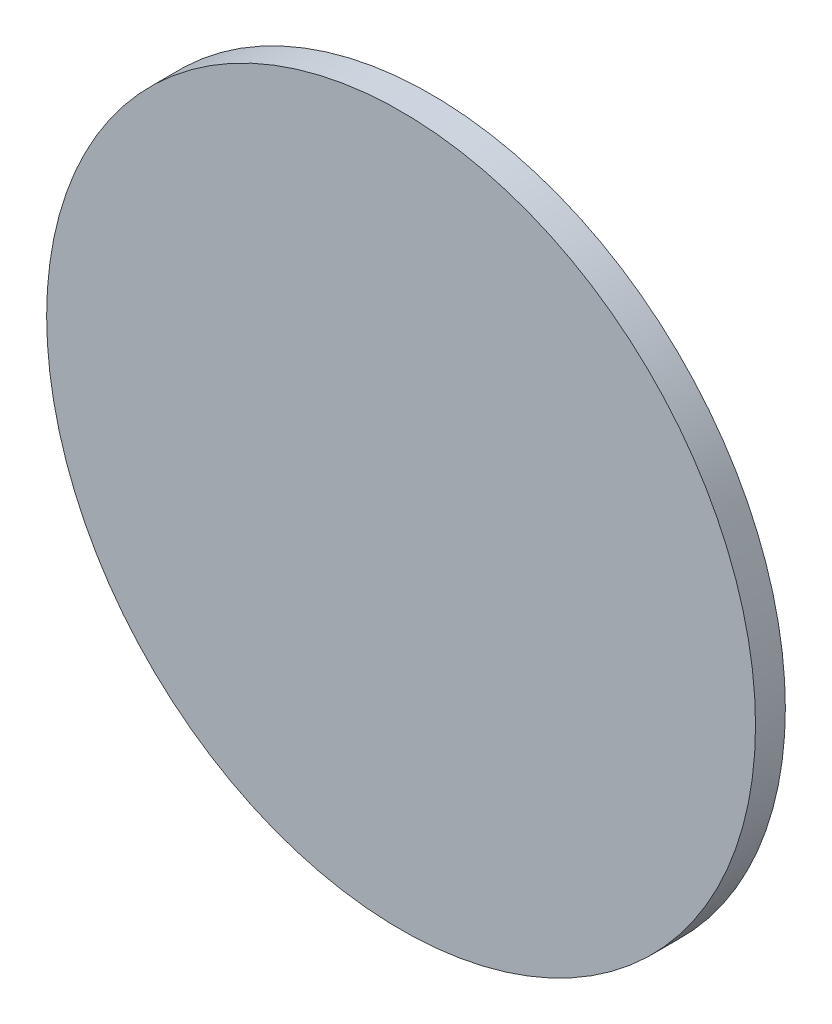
ISO-10303-21;
HEADER;
FILE_DESCRIPTION(('STEP AP214'),'2;1');
FILE_NAME('part.step','',(''),(''),'','','');
FILE_SCHEMA(('AUTOMOTIVE_DESIGN { 1 0 10303 214 1 1 1 1 }'));
ENDSEC;
DATA;
#1=APPLICATION_CONTEXT('core data for automotive mechanical design processes');
#2=APPLICATION_PROTOCOL_DEFINITION('international standard','automotive_design',2000,#1);
#3=PRODUCT_CONTEXT('',#1,'mechanical');
#4=PRODUCT('Part','Part','',(#3));
#5=PRODUCT_RELATED_PRODUCT_CATEGORY('part','',(#4));
#6=PRODUCT_DEFINITION_FORMATION('','',#4);
#7=PRODUCT_DEFINITION_CONTEXT('part definition',#1,'design');
#8=PRODUCT_DEFINITION('design','',#6,#7);
#9=PRODUCT_DEFINITION_SHAPE('','',#8);
#10=(LENGTH_UNIT() NAMED_UNIT(*) SI_UNIT(.MILLI.,.METRE.));
#11=(NAMED_UNIT(*) PLANE_ANGLE_UNIT() SI_UNIT($,.RADIAN.));
#12=(NAMED_UNIT(*) SI_UNIT($,.STERADIAN.) SOLID_ANGLE_UNIT());
#13=UNCERTAINTY_MEASURE_WITH_UNIT(LENGTH_MEASURE(1.E-05),#10,'distance_accuracy_value','');
#14=(GEOMETRIC_REPRESENTATION_CONTEXT(3) GLOBAL_UNCERTAINTY_ASSIGNED_CONTEXT((#13)) GLOBAL_UNIT_ASSIGNED_CONTEXT((#10,
#11,#12)) REPRESENTATION_CONTEXT('',''));
#15=CARTESIAN_POINT('',(0.,0.,0.));
#16=DIRECTION('',(0.,0.,1.));
#17=DIRECTION('',(1.,0.,0.));
#18=AXIS2_PLACEMENT_3D('',#15,#16,#17);
#19=CARTESIAN_POINT('',(0.,0.,0.8));
#20=DIRECTION('',(0.,0.,-1.));
#21=DIRECTION('',(-1.,0.,0.));
#22=AXIS2_PLACEMENT_3D('',#19,#20,#21);
#23=CYLINDRICAL_SURFACE('',#22,9.5);
#24=CARTESIAN_POINT('',(0.,0.,0.8));
#25=DIRECTION('',(0.,0.,1.));
#26=DIRECTION('',(1.,0.,0.));
#27=AXIS2_PLACEMENT_3D('',#24,#25,#26);
#28=CIRCLE('',#27,9.5);
#29=CARTESIAN_POINT('',(9.5,0.,0.8));
#30=VERTEX_POINT('',#29);
#31=EDGE_CURVE('E10',#30,#30,#28,.T.);
#32=ORIENTED_EDGE('',*,*,#31,.F.);
#33=EDGE_LOOP('',(#32));
#34=FACE_BOUND('',#33,.T.);
#35=CARTESIAN_POINT('',(0.,0.,0.));
#36=DIRECTION('',(0.,0.,1.));
#37=DIRECTION('',(1.,0.,0.));
#38=AXIS2_PLACEMENT_3D('',#35,#36,#37);
#39=CIRCLE('',#38,9.5);
#40=CARTESIAN_POINT('',(9.5,0.,0.));
#41=VERTEX_POINT('',#40);
#42=EDGE_CURVE('E17',#41,#41,#39,.T.);
#43=ORIENTED_EDGE('',*,*,#42,.T.);
#44=EDGE_LOOP('',(#43));
#45=FACE_BOUND('',#44,.T.);
#46=ADVANCED_FACE('F14',(#34,#45),#23,.T.);
#47=CARTESIAN_POINT('',(0.,0.,0.8));
#48=DIRECTION('',(0.,0.,1.));
#49=DIRECTION('',(1.,0.,0.));
#50=AXIS2_PLACEMENT_3D('',#47,#48,#49);
#51=PLANE('',#50);
#52=ORIENTED_EDGE('',*,*,#31,.T.);
#53=EDGE_LOOP('',(#52));
#54=FACE_BOUND('',#53,.T.);
#55=ADVANCED_FACE('F29',(#54),#51,.T.);
#56=CARTESIAN_POINT('',(0.,0.,0.));
#57=DIRECTION('',(0.,0.,1.));
#58=DIRECTION('',(1.,0.,0.));
#59=AXIS2_PLACEMENT_3D('',#56,#57,#58);
#60=PLANE('',#59);
#61=ORIENTED_EDGE('',*,*,#42,.F.);
#62=EDGE_LOOP('',(#61));
#63=FACE_BOUND('',#62,.T.);
#64=ADVANCED_FACE('F27',(#63),#60,.F.);
#65=CLOSED_SHELL('',(#46,#55,#64));
#66=MANIFOLD_SOLID_BREP('B1',#65);
#67=ADVANCED_BREP_SHAPE_REPRESENTATION('',(#18,#66),#14);
#68=SHAPE_DEFINITION_REPRESENTATION(#9,#67);
ENDSEC;
END-ISO-10303-21;
